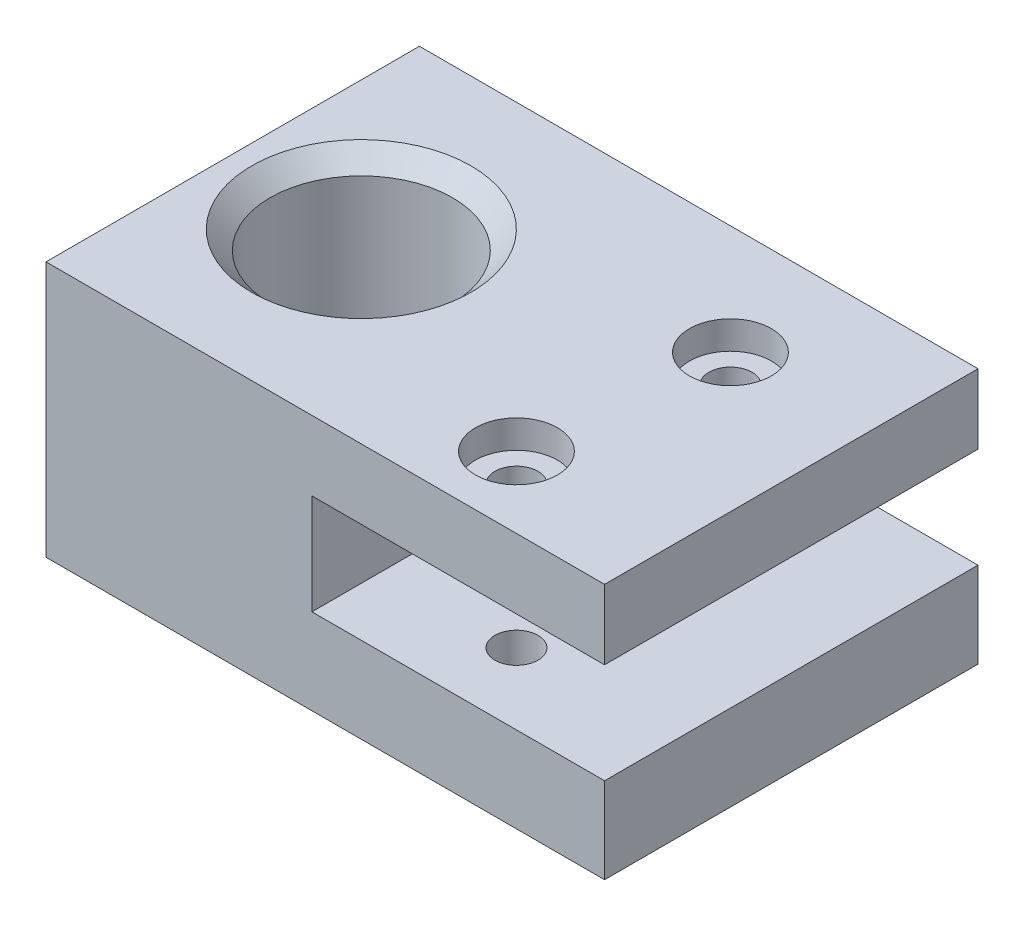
ISO-10303-21;
HEADER;
FILE_DESCRIPTION(('STEP AP214'),'2;1');
FILE_NAME('part.step','',(''),(''),'','','');
FILE_SCHEMA(('AUTOMOTIVE_DESIGN { 1 0 10303 214 1 1 1 1 }'));
ENDSEC;
DATA;
#1=APPLICATION_CONTEXT('core data for automotive mechanical design processes');
#2=APPLICATION_PROTOCOL_DEFINITION('international standard','automotive_design',2000,#1);
#3=PRODUCT_CONTEXT('',#1,'mechanical');
#4=PRODUCT('Part','Part','',(#3));
#5=PRODUCT_RELATED_PRODUCT_CATEGORY('part','',(#4));
#6=PRODUCT_DEFINITION_FORMATION('','',#4);
#7=PRODUCT_DEFINITION_CONTEXT('part definition',#1,'design');
#8=PRODUCT_DEFINITION('design','',#6,#7);
#9=PRODUCT_DEFINITION_SHAPE('','',#8);
#10=(LENGTH_UNIT() NAMED_UNIT(*) SI_UNIT(.MILLI.,.METRE.));
#11=(NAMED_UNIT(*) PLANE_ANGLE_UNIT() SI_UNIT($,.RADIAN.));
#12=(NAMED_UNIT(*) SI_UNIT($,.STERADIAN.) SOLID_ANGLE_UNIT());
#13=UNCERTAINTY_MEASURE_WITH_UNIT(LENGTH_MEASURE(1.E-05),#10,'distance_accuracy_value','');
#14=(GEOMETRIC_REPRESENTATION_CONTEXT(3) GLOBAL_UNCERTAINTY_ASSIGNED_CONTEXT((#13)) GLOBAL_UNIT_ASSIGNED_CONTEXT((#10,
#11,#12)) REPRESENTATION_CONTEXT('',''));
#15=CARTESIAN_POINT('',(0.,0.,0.));
#16=DIRECTION('',(0.,0.,1.));
#17=DIRECTION('',(1.,0.,0.));
#18=AXIS2_PLACEMENT_3D('',#15,#16,#17);
#19=CARTESIAN_POINT('',(90.5104219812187,70.612,-44.268252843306));
#20=DIRECTION('',(-1.,0.,0.));
#21=DIRECTION('',(0.,0.,1.));
#22=AXIS2_PLACEMENT_3D('',#19,#20,#21);
#23=PLANE('',#22);
#24=DIRECTION('',(0.,-1.,0.));
#25=VECTOR('',#24,1.);
#26=CARTESIAN_POINT('',(90.5104219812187,70.612,-44.268252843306));
#27=LINE('',#26,#25);
#28=CARTESIAN_POINT('',(90.5104219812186,23.660106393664,-44.2682528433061));
#29=VERTEX_POINT('',#28);
#30=CARTESIAN_POINT('',(90.5104219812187,0.,-44.268252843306));
#31=VERTEX_POINT('',#30);
#32=EDGE_CURVE('E150',#29,#31,#27,.T.);
#33=ORIENTED_EDGE('',*,*,#32,.F.);
#34=DIRECTION('',(0.,0.,1.));
#35=VECTOR('',#34,1.);
#36=CARTESIAN_POINT('',(90.5104219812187,23.660106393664,-44.268252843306));
#37=LINE('',#36,#35);
#38=CARTESIAN_POINT('',(90.5104219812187,23.660106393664,58.8040970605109));
#39=VERTEX_POINT('',#38);
#40=EDGE_CURVE('E126',#29,#39,#37,.T.);
#41=ORIENTED_EDGE('',*,*,#40,.T.);
#42=DIRECTION('',(0.,-1.,0.));
#43=VECTOR('',#42,1.);
#44=CARTESIAN_POINT('',(90.5104219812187,70.612,58.8040970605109));
#45=LINE('',#44,#43);
#46=CARTESIAN_POINT('',(90.5104219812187,0.,58.8040970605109));
#47=VERTEX_POINT('',#46);
#48=EDGE_CURVE('E154',#39,#47,#45,.T.);
#49=ORIENTED_EDGE('',*,*,#48,.T.);
#50=DIRECTION('',(0.,0.,-1.));
#51=VECTOR('',#50,1.);
#52=CARTESIAN_POINT('',(90.5104219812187,0.,-44.268252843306));
#53=LINE('',#52,#51);
#54=EDGE_CURVE('E135',#47,#31,#53,.T.);
#55=ORIENTED_EDGE('',*,*,#54,.T.);
#56=EDGE_LOOP('',(#33,#41,#49,#55));
#57=FACE_BOUND('',#56,.T.);
#58=ADVANCED_FACE('F27',(#57),#23,.F.);
#59=CARTESIAN_POINT('',(-63.6576227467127,70.612,-44.268252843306));
#60=DIRECTION('',(1.,0.,0.));
#61=DIRECTION('',(0.,0.,-1.));
#62=AXIS2_PLACEMENT_3D('',#59,#60,#61);
#63=PLANE('',#62);
#64=DIRECTION('',(0.,0.,1.));
#65=VECTOR('',#64,1.);
#66=CARTESIAN_POINT('',(-63.6576227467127,0.,-44.268252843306));
#67=LINE('',#66,#65);
#68=CARTESIAN_POINT('',(-63.6576227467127,0.,-44.268252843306));
#69=VERTEX_POINT('',#68);
#70=CARTESIAN_POINT('',(-63.6576227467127,0.,58.8040970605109));
#71=VERTEX_POINT('',#70);
#72=EDGE_CURVE('E129',#69,#71,#67,.T.);
#73=ORIENTED_EDGE('',*,*,#72,.T.);
#74=DIRECTION('',(0.,-1.,0.));
#75=VECTOR('',#74,1.);
#76=CARTESIAN_POINT('',(-63.6576227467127,70.612,58.8040970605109));
#77=LINE('',#76,#75);
#78=CARTESIAN_POINT('',(-63.6576227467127,70.612,58.8040970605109));
#79=VERTEX_POINT('',#78);
#80=EDGE_CURVE('E157',#79,#71,#77,.T.);
#81=ORIENTED_EDGE('',*,*,#80,.F.);
#82=DIRECTION('',(0.,0.,1.));
#83=VECTOR('',#82,1.);
#84=CARTESIAN_POINT('',(-63.6576227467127,70.612,-44.268252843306));
#85=LINE('',#84,#83);
#86=CARTESIAN_POINT('',(-63.6576227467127,70.612,-44.268252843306));
#87=VERTEX_POINT('',#86);
#88=EDGE_CURVE('E140',#87,#79,#85,.T.);
#89=ORIENTED_EDGE('',*,*,#88,.F.);
#90=DIRECTION('',(0.,-1.,0.));
#91=VECTOR('',#90,1.);
#92=CARTESIAN_POINT('',(-63.6576227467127,70.612,-44.268252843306));
#93=LINE('',#92,#91);
#94=EDGE_CURVE('E147',#87,#69,#93,.T.);
#95=ORIENTED_EDGE('',*,*,#94,.T.);
#96=EDGE_LOOP('',(#73,#81,#89,#95));
#97=FACE_BOUND('',#96,.T.);
#98=ADVANCED_FACE('F29',(#97),#63,.F.);
#99=CARTESIAN_POINT('',(-63.6576227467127,70.612,58.8040970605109));
#100=DIRECTION('',(0.,0.,-1.));
#101=DIRECTION('',(-1.,0.,0.));
#102=AXIS2_PLACEMENT_3D('',#99,#100,#101);
#103=PLANE('',#102);
#104=ORIENTED_EDGE('',*,*,#48,.F.);
#105=DIRECTION('',(1.,0.,0.));
#106=VECTOR('',#105,1.);
#107=CARTESIAN_POINT('',(93.7683238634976,23.660106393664,58.8040970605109));
#108=LINE('',#107,#106);
#109=CARTESIAN_POINT('',(9.74099024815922,23.660106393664,58.8040970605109));
#110=VERTEX_POINT('',#109);
#111=EDGE_CURVE('E116',#110,#39,#108,.T.);
#112=ORIENTED_EDGE('',*,*,#111,.F.);
#113=DIRECTION('',(0.,-1.,0.));
#114=VECTOR('',#113,1.);
#115=CARTESIAN_POINT('',(9.74099024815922,51.3743848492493,58.8040970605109));
#116=LINE('',#115,#114);
#117=CARTESIAN_POINT('',(9.74099024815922,51.3743848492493,58.8040970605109));
#118=VERTEX_POINT('',#117);
#119=EDGE_CURVE('E105',#118,#110,#116,.T.);
#120=ORIENTED_EDGE('',*,*,#119,.F.);
#121=DIRECTION('',(-1.,0.,0.));
#122=VECTOR('',#121,1.);
#123=CARTESIAN_POINT('',(93.7683238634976,51.3743848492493,58.8040970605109));
#124=LINE('',#123,#122);
#125=CARTESIAN_POINT('',(90.5104219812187,51.3743848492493,58.8040970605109));
#126=VERTEX_POINT('',#125);
#127=EDGE_CURVE('E95',#126,#118,#124,.T.);
#128=ORIENTED_EDGE('',*,*,#127,.F.);
#129=CARTESIAN_POINT('',(90.5104219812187,70.612,58.8040970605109));
#130=VERTEX_POINT('',#129);
#131=EDGE_CURVE('E155',#130,#126,#45,.T.);
#132=ORIENTED_EDGE('',*,*,#131,.F.);
#133=DIRECTION('',(1.,0.,0.));
#134=VECTOR('',#133,1.);
#135=CARTESIAN_POINT('',(-63.6576227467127,70.612,58.8040970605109));
#136=LINE('',#135,#134);
#137=EDGE_CURVE('E142',#79,#130,#136,.T.);
#138=ORIENTED_EDGE('',*,*,#137,.F.);
#139=ORIENTED_EDGE('',*,*,#80,.T.);
#140=DIRECTION('',(1.,0.,0.));
#141=VECTOR('',#140,1.);
#142=CARTESIAN_POINT('',(-63.6576227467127,0.,58.8040970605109));
#143=LINE('',#142,#141);
#144=EDGE_CURVE('E132',#71,#47,#143,.T.);
#145=ORIENTED_EDGE('',*,*,#144,.T.);
#146=EDGE_LOOP('',(#104,#112,#120,#128,#132,#138,#139,#145));
#147=FACE_BOUND('',#146,.T.);
#148=ADVANCED_FACE('F115',(#147),#103,.F.);
#149=ORIENTED_EDGE('',*,*,#131,.T.);
#150=DIRECTION('',(0.,0.,-1.));
#151=VECTOR('',#150,1.);
#152=CARTESIAN_POINT('',(90.5104219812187,51.3743848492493,-44.268252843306));
#153=LINE('',#152,#151);
#154=CARTESIAN_POINT('',(90.5104219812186,51.3743848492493,-44.2682528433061));
#155=VERTEX_POINT('',#154);
#156=EDGE_CURVE('E100',#126,#155,#153,.T.);
#157=ORIENTED_EDGE('',*,*,#156,.T.);
#158=CARTESIAN_POINT('',(90.5104219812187,70.612,-44.268252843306));
#159=VERTEX_POINT('',#158);
#160=EDGE_CURVE('E151',#159,#155,#27,.T.);
#161=ORIENTED_EDGE('',*,*,#160,.F.);
#162=DIRECTION('',(0.,0.,-1.));
#163=VECTOR('',#162,1.);
#164=CARTESIAN_POINT('',(90.5104219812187,70.612,-44.268252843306));
#165=LINE('',#164,#163);
#166=EDGE_CURVE('E144',#130,#159,#165,.T.);
#167=ORIENTED_EDGE('',*,*,#166,.F.);
#168=EDGE_LOOP('',(#149,#157,#161,#167));
#169=FACE_BOUND('',#168,.T.);
#170=ADVANCED_FACE('F203',(#169),#23,.F.);
#171=CARTESIAN_POINT('',(-63.6576227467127,70.612,-44.268252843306));
#172=DIRECTION('',(0.,0.,1.));
#173=DIRECTION('',(1.,0.,0.));
#174=AXIS2_PLACEMENT_3D('',#171,#172,#173);
#175=PLANE('',#174);
#176=DIRECTION('',(0.,-1.,0.));
#177=VECTOR('',#176,1.);
#178=CARTESIAN_POINT('',(9.74099024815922,51.3743848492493,-44.2682528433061));
#179=LINE('',#178,#177);
#180=CARTESIAN_POINT('',(9.74099024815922,51.3743848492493,-44.268252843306));
#181=VERTEX_POINT('',#180);
#182=CARTESIAN_POINT('',(9.74099024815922,23.660106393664,-44.2682528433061));
#183=VERTEX_POINT('',#182);
#184=EDGE_CURVE('E44',#181,#183,#179,.T.);
#185=ORIENTED_EDGE('',*,*,#184,.T.);
#186=DIRECTION('',(1.,0.,0.));
#187=VECTOR('',#186,1.);
#188=CARTESIAN_POINT('',(93.7683238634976,23.660106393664,-44.2682528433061));
#189=LINE('',#188,#187);
#190=EDGE_CURVE('E112',#183,#29,#189,.T.);
#191=ORIENTED_EDGE('',*,*,#190,.T.);
#192=ORIENTED_EDGE('',*,*,#32,.T.);
#193=DIRECTION('',(-1.,0.,0.));
#194=VECTOR('',#193,1.);
#195=CARTESIAN_POINT('',(-63.6576227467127,0.,-44.268252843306));
#196=LINE('',#195,#194);
#197=EDGE_CURVE('E138',#31,#69,#196,.T.);
#198=ORIENTED_EDGE('',*,*,#197,.T.);
#199=ORIENTED_EDGE('',*,*,#94,.F.);
#200=DIRECTION('',(-1.,0.,0.));
#201=VECTOR('',#200,1.);
#202=CARTESIAN_POINT('',(-63.6576227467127,70.612,-44.268252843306));
#203=LINE('',#202,#201);
#204=EDGE_CURVE('E52',#159,#87,#203,.T.);
#205=ORIENTED_EDGE('',*,*,#204,.F.);
#206=ORIENTED_EDGE('',*,*,#160,.T.);
#207=DIRECTION('',(-1.,0.,0.));
#208=VECTOR('',#207,1.);
#209=CARTESIAN_POINT('',(-63.6576227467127,51.3743848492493,-44.268252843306));
#210=LINE('',#209,#208);
#211=EDGE_CURVE('E160',#155,#181,#210,.T.);
#212=ORIENTED_EDGE('',*,*,#211,.T.);
#213=EDGE_LOOP('',(#185,#191,#192,#198,#199,#205,#206,#212));
#214=FACE_BOUND('',#213,.T.);
#215=ADVANCED_FACE('F212',(#214),#175,.F.);
#216=CARTESIAN_POINT('',(-63.6576227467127,70.612,58.8040970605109));
#217=DIRECTION('',(0.,1.,0.));
#218=DIRECTION('',(0.,0.,1.));
#219=AXIS2_PLACEMENT_3D('',#216,#217,#218);
#220=PLANE('',#219);
#221=CARTESIAN_POINT('',(52.4104219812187,70.612,-14.040679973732));
#222=DIRECTION('',(0.,1.,0.));
#223=DIRECTION('',(0.,0.,1.));
#224=AXIS2_PLACEMENT_3D('',#221,#222,#223);
#225=CIRCLE('',#224,11.31062);
#226=CARTESIAN_POINT('',(52.4104219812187,70.612,-2.73005997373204));
#227=VERTEX_POINT('',#226);
#228=EDGE_CURVE('E249',#227,#227,#225,.T.);
#229=ORIENTED_EDGE('',*,*,#228,.F.);
#230=EDGE_LOOP('',(#229));
#231=FACE_BOUND('',#230,.T.);
#232=CARTESIAN_POINT('',(46.5618147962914,70.612,39.1738708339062));
#233=DIRECTION('',(0.,1.,0.));
#234=DIRECTION('',(0.,0.,1.));
#235=AXIS2_PLACEMENT_3D('',#232,#233,#234);
#236=CIRCLE('',#235,11.31062);
#237=CARTESIAN_POINT('',(46.5618147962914,70.612,50.4844908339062));
#238=VERTEX_POINT('',#237);
#239=EDGE_CURVE('E166',#238,#238,#236,.T.);
#240=ORIENTED_EDGE('',*,*,#239,.F.);
#241=EDGE_LOOP('',(#240));
#242=FACE_BOUND('',#241,.T.);
#243=CARTESIAN_POINT('',(-27.9715870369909,70.612,7.45869624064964));
#244=DIRECTION('',(0.,1.,0.));
#245=DIRECTION('',(0.,0.,1.));
#246=AXIS2_PLACEMENT_3D('',#243,#244,#245);
#247=CIRCLE('',#246,30.2621854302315);
#248=CARTESIAN_POINT('',(-27.9715870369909,70.612,37.7208816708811));
#249=VERTEX_POINT('',#248);
#250=EDGE_CURVE('E11',#249,#249,#247,.F.);
#251=ORIENTED_EDGE('',*,*,#250,.T.);
#252=EDGE_LOOP('',(#251));
#253=FACE_BOUND('',#252,.T.);
#254=ORIENTED_EDGE('',*,*,#88,.T.);
#255=ORIENTED_EDGE('',*,*,#137,.T.);
#256=ORIENTED_EDGE('',*,*,#166,.T.);
#257=ORIENTED_EDGE('',*,*,#204,.T.);
#258=EDGE_LOOP('',(#254,#255,#256,#257));
#259=FACE_BOUND('',#258,.T.);
#260=ADVANCED_FACE('F217',(#231,#242,#253,#259),#220,.T.);
#261=CARTESIAN_POINT('',(-63.6576227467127,0.,58.8040970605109));
#262=DIRECTION('',(0.,1.,0.));
#263=DIRECTION('',(0.,0.,1.));
#264=AXIS2_PLACEMENT_3D('',#261,#262,#263);
#265=PLANE('',#264);
#266=CARTESIAN_POINT('',(52.4104219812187,0.,-14.040679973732));
#267=DIRECTION('',(0.,1.,0.));
#268=DIRECTION('',(0.,0.,1.));
#269=AXIS2_PLACEMENT_3D('',#266,#267,#268);
#270=CIRCLE('',#269,5.95248999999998);
#271=CARTESIAN_POINT('',(52.4104219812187,0.,-8.08818997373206));
#272=VERTEX_POINT('',#271);
#273=EDGE_CURVE('E308',#272,#272,#270,.T.);
#274=ORIENTED_EDGE('',*,*,#273,.T.);
#275=EDGE_LOOP('',(#274));
#276=FACE_BOUND('',#275,.T.);
#277=CARTESIAN_POINT('',(46.5618147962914,0.,39.1738708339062));
#278=DIRECTION('',(0.,1.,0.));
#279=DIRECTION('',(0.,0.,1.));
#280=AXIS2_PLACEMENT_3D('',#277,#278,#279);
#281=CIRCLE('',#280,5.95248999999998);
#282=CARTESIAN_POINT('',(46.5618147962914,0.,45.1263608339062));
#283=VERTEX_POINT('',#282);
#284=EDGE_CURVE('E265',#283,#283,#281,.T.);
#285=ORIENTED_EDGE('',*,*,#284,.T.);
#286=EDGE_LOOP('',(#285));
#287=FACE_BOUND('',#286,.T.);
#288=CARTESIAN_POINT('',(-27.9715870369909,0.,7.45869624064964));
#289=DIRECTION('',(0.,1.,0.));
#290=DIRECTION('',(0.,0.,1.));
#291=AXIS2_PLACEMENT_3D('',#288,#289,#290);
#292=CIRCLE('',#291,25.1821854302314);
#293=CARTESIAN_POINT('',(-27.9715870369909,0.,32.6408816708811));
#294=VERTEX_POINT('',#293);
#295=EDGE_CURVE('E106',#294,#294,#292,.T.);
#296=ORIENTED_EDGE('',*,*,#295,.T.);
#297=EDGE_LOOP('',(#296));
#298=FACE_BOUND('',#297,.T.);
#299=ORIENTED_EDGE('',*,*,#72,.F.);
#300=ORIENTED_EDGE('',*,*,#197,.F.);
#301=ORIENTED_EDGE('',*,*,#54,.F.);
#302=ORIENTED_EDGE('',*,*,#144,.F.);
#303=EDGE_LOOP('',(#299,#300,#301,#302));
#304=FACE_BOUND('',#303,.T.);
#305=ADVANCED_FACE('F183',(#276,#287,#298,#304),#265,.F.);
#306=CARTESIAN_POINT('',(93.7683238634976,23.660106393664,-44.2682528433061));
#307=DIRECTION('',(0.,-1.,0.));
#308=DIRECTION('',(0.,0.,-1.));
#309=AXIS2_PLACEMENT_3D('',#306,#307,#308);
#310=PLANE('',#309);
#311=CARTESIAN_POINT('',(52.4104219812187,23.660106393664,-14.040679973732));
#312=DIRECTION('',(0.,-1.,0.));
#313=DIRECTION('',(0.,0.,-1.));
#314=AXIS2_PLACEMENT_3D('',#311,#312,#313);
#315=CIRCLE('',#314,5.95248999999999);
#316=CARTESIAN_POINT('',(52.4104219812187,23.660106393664,-19.993169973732));
#317=VERTEX_POINT('',#316);
#318=EDGE_CURVE('E258',#317,#317,#315,.T.);
#319=ORIENTED_EDGE('',*,*,#318,.T.);
#320=EDGE_LOOP('',(#319));
#321=FACE_BOUND('',#320,.T.);
#322=CARTESIAN_POINT('',(46.5618147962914,23.660106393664,39.1738708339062));
#323=DIRECTION('',(0.,-1.,0.));
#324=DIRECTION('',(0.,0.,-1.));
#325=AXIS2_PLACEMENT_3D('',#322,#323,#324);
#326=CIRCLE('',#325,5.95248999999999);
#327=CARTESIAN_POINT('',(46.5618147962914,23.660106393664,33.2213808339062));
#328=VERTEX_POINT('',#327);
#329=EDGE_CURVE('E165',#328,#328,#326,.T.);
#330=ORIENTED_EDGE('',*,*,#329,.T.);
#331=EDGE_LOOP('',(#330));
#332=FACE_BOUND('',#331,.T.);
#333=ORIENTED_EDGE('',*,*,#190,.F.);
#334=DIRECTION('',(0.,0.,1.));
#335=VECTOR('',#334,1.);
#336=CARTESIAN_POINT('',(9.74099024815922,23.660106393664,-44.2682528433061));
#337=LINE('',#336,#335);
#338=EDGE_CURVE('E111',#183,#110,#337,.T.);
#339=ORIENTED_EDGE('',*,*,#338,.T.);
#340=ORIENTED_EDGE('',*,*,#111,.T.);
#341=ORIENTED_EDGE('',*,*,#40,.F.);
#342=EDGE_LOOP('',(#333,#339,#340,#341));
#343=FACE_BOUND('',#342,.T.);
#344=ADVANCED_FACE('F228',(#321,#332,#343),#310,.F.);
#345=CARTESIAN_POINT('',(93.7683238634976,51.3743848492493,-44.2682528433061));
#346=DIRECTION('',(0.,1.,0.));
#347=DIRECTION('',(0.,0.,1.));
#348=AXIS2_PLACEMENT_3D('',#345,#346,#347);
#349=PLANE('',#348);
#350=CARTESIAN_POINT('',(52.4104219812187,51.3743848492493,-14.040679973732));
#351=DIRECTION('',(0.,1.,0.));
#352=DIRECTION('',(0.,0.,1.));
#353=AXIS2_PLACEMENT_3D('',#350,#351,#352);
#354=CIRCLE('',#353,5.95248999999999);
#355=CARTESIAN_POINT('',(52.4104219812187,51.3743848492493,-8.08818997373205));
#356=VERTEX_POINT('',#355);
#357=EDGE_CURVE('E31',#356,#356,#354,.T.);
#358=ORIENTED_EDGE('',*,*,#357,.T.);
#359=EDGE_LOOP('',(#358));
#360=FACE_BOUND('',#359,.T.);
#361=CARTESIAN_POINT('',(46.5618147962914,51.3743848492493,39.1738708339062));
#362=DIRECTION('',(0.,1.,0.));
#363=DIRECTION('',(0.,0.,1.));
#364=AXIS2_PLACEMENT_3D('',#361,#362,#363);
#365=CIRCLE('',#364,5.95248999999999);
#366=CARTESIAN_POINT('',(46.5618147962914,51.3743848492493,45.1263608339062));
#367=VERTEX_POINT('',#366);
#368=EDGE_CURVE('E163',#367,#367,#365,.T.);
#369=ORIENTED_EDGE('',*,*,#368,.T.);
#370=EDGE_LOOP('',(#369));
#371=FACE_BOUND('',#370,.T.);
#372=ORIENTED_EDGE('',*,*,#127,.T.);
#373=DIRECTION('',(0.,0.,1.));
#374=VECTOR('',#373,1.);
#375=CARTESIAN_POINT('',(9.74099024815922,51.3743848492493,-44.2682528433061));
#376=LINE('',#375,#374);
#377=EDGE_CURVE('E97',#181,#118,#376,.T.);
#378=ORIENTED_EDGE('',*,*,#377,.F.);
#379=ORIENTED_EDGE('',*,*,#211,.F.);
#380=ORIENTED_EDGE('',*,*,#156,.F.);
#381=EDGE_LOOP('',(#372,#378,#379,#380));
#382=FACE_BOUND('',#381,.T.);
#383=ADVANCED_FACE('F96',(#360,#371,#382),#349,.F.);
#384=CARTESIAN_POINT('',(9.74099024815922,51.3743848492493,-44.2682528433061));
#385=DIRECTION('',(-1.,0.,0.));
#386=DIRECTION('',(0.,0.,1.));
#387=AXIS2_PLACEMENT_3D('',#384,#385,#386);
#388=PLANE('',#387);
#389=ORIENTED_EDGE('',*,*,#119,.T.);
#390=ORIENTED_EDGE('',*,*,#338,.F.);
#391=ORIENTED_EDGE('',*,*,#184,.F.);
#392=ORIENTED_EDGE('',*,*,#377,.T.);
#393=EDGE_LOOP('',(#389,#390,#391,#392));
#394=FACE_BOUND('',#393,.T.);
#395=ADVANCED_FACE('F109',(#394),#388,.F.);
#396=CARTESIAN_POINT('',(-27.9715870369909,0.,7.45869624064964));
#397=DIRECTION('',(0.,1.,0.));
#398=DIRECTION('',(0.,0.,1.));
#399=AXIS2_PLACEMENT_3D('',#396,#397,#398);
#400=CYLINDRICAL_SURFACE('',#399,25.1821854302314);
#401=CARTESIAN_POINT('',(-27.9715870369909,65.532,7.45869624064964));
#402=DIRECTION('',(0.,1.,0.));
#403=DIRECTION('',(0.,0.,1.));
#404=AXIS2_PLACEMENT_3D('',#401,#402,#403);
#405=CIRCLE('',#404,25.1821854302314);
#406=CARTESIAN_POINT('',(-27.9715870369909,65.532,32.6408816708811));
#407=VERTEX_POINT('',#406);
#408=EDGE_CURVE('E36',#407,#407,#405,.T.);
#409=ORIENTED_EDGE('',*,*,#408,.T.);
#410=EDGE_LOOP('',(#409));
#411=FACE_BOUND('',#410,.T.);
#412=ORIENTED_EDGE('',*,*,#295,.F.);
#413=EDGE_LOOP('',(#412));
#414=FACE_BOUND('',#413,.T.);
#415=ADVANCED_FACE('F186',(#411,#414),#400,.F.);
#416=CARTESIAN_POINT('',(-27.9715870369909,65.532,7.45869624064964));
#417=DIRECTION('',(0.,1.,0.));
#418=DIRECTION('',(0.,0.,1.));
#419=AXIS2_PLACEMENT_3D('',#416,#417,#418);
#420=CONICAL_SURFACE('',#419,25.1821854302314,0.78539816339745);
#421=CARTESIAN_POINT('',(-27.9715870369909,70.612,37.7208816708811));
#422=CARTESIAN_POINT('',(-27.9715870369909,70.5590833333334,37.6679650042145));
#423=CARTESIAN_POINT('',(-27.9715870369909,70.5061666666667,37.6150483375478));
#424=CARTESIAN_POINT('',(-27.9715870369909,70.4003333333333,37.5092150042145));
#425=CARTESIAN_POINT('',(-27.9715870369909,70.3474166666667,37.4562983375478));
#426=CARTESIAN_POINT('',(-27.9715870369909,70.2415833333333,37.3504650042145));
#427=CARTESIAN_POINT('',(-27.9715870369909,70.1886666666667,37.2975483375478));
#428=CARTESIAN_POINT('',(-27.9715870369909,70.0828333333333,37.1917150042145));
#429=CARTESIAN_POINT('',(-27.9715870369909,70.0299166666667,37.1387983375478));
#430=CARTESIAN_POINT('',(-27.9715870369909,69.9240833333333,37.0329650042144));
#431=CARTESIAN_POINT('',(-27.9715870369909,69.8711666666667,36.9800483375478));
#432=CARTESIAN_POINT('',(-27.9715870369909,69.7653333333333,36.8742150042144));
#433=CARTESIAN_POINT('',(-27.9715870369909,69.7124166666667,36.8212983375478));
#434=CARTESIAN_POINT('',(-27.9715870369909,69.6065833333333,36.7154650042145));
#435=CARTESIAN_POINT('',(-27.9715870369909,69.5536666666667,36.6625483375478));
#436=CARTESIAN_POINT('',(-27.9715870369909,69.4478333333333,36.5567150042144));
#437=CARTESIAN_POINT('',(-27.9715870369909,69.3949166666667,36.5037983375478));
#438=CARTESIAN_POINT('',(-27.9715870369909,69.2890833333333,36.3979650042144));
#439=CARTESIAN_POINT('',(-27.9715870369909,69.2361666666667,36.3450483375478));
#440=CARTESIAN_POINT('',(-27.9715870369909,69.1303333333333,36.2392150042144));
#441=CARTESIAN_POINT('',(-27.9715870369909,69.0774166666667,36.1862983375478));
#442=CARTESIAN_POINT('',(-27.9715870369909,68.9715833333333,36.0804650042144));
#443=CARTESIAN_POINT('',(-27.9715870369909,68.9186666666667,36.0275483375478));
#444=CARTESIAN_POINT('',(-27.9715870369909,68.8128333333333,35.9217150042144));
#445=CARTESIAN_POINT('',(-27.9715870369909,68.7599166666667,35.8687983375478));
#446=CARTESIAN_POINT('',(-27.9715870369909,68.6540833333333,35.7629650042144));
#447=CARTESIAN_POINT('',(-27.9715870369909,68.6011666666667,35.7100483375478));
#448=CARTESIAN_POINT('',(-27.9715870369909,68.4953333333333,35.6042150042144));
#449=CARTESIAN_POINT('',(-27.9715870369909,68.4424166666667,35.5512983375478));
#450=CARTESIAN_POINT('',(-27.9715870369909,68.3365833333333,35.4454650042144));
#451=CARTESIAN_POINT('',(-27.9715870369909,68.2836666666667,35.3925483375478));
#452=CARTESIAN_POINT('',(-27.9715870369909,68.1778333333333,35.2867150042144));
#453=CARTESIAN_POINT('',(-27.9715870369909,68.1249166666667,35.2337983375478));
#454=CARTESIAN_POINT('',(-27.9715870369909,68.0190833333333,35.1279650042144));
#455=CARTESIAN_POINT('',(-27.9715870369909,67.9661666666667,35.0750483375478));
#456=CARTESIAN_POINT('',(-27.9715870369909,67.8603333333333,34.9692150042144));
#457=CARTESIAN_POINT('',(-27.9715870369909,67.8074166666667,34.9162983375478));
#458=CARTESIAN_POINT('',(-27.9715870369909,67.7015833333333,34.8104650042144));
#459=CARTESIAN_POINT('',(-27.9715870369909,67.6486666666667,34.7575483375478));
#460=CARTESIAN_POINT('',(-27.9715870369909,67.5428333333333,34.6517150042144));
#461=CARTESIAN_POINT('',(-27.9715870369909,67.4899166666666,34.5987983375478));
#462=CARTESIAN_POINT('',(-27.9715870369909,67.3840833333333,34.4929650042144));
#463=CARTESIAN_POINT('',(-27.9715870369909,67.3311666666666,34.4400483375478));
#464=CARTESIAN_POINT('',(-27.9715870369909,67.2253333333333,34.3342150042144));
#465=CARTESIAN_POINT('',(-27.9715870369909,67.1724166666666,34.2812983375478));
#466=CARTESIAN_POINT('',(-27.9715870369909,67.0665833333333,34.1754650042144));
#467=CARTESIAN_POINT('',(-27.9715870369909,67.0136666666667,34.1225483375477));
#468=CARTESIAN_POINT('',(-27.9715870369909,66.9078333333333,34.0167150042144));
#469=CARTESIAN_POINT('',(-27.9715870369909,66.8549166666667,33.9637983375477));
#470=CARTESIAN_POINT('',(-27.9715870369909,66.7490833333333,33.8579650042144));
#471=CARTESIAN_POINT('',(-27.9715870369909,66.6961666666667,33.8050483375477));
#472=CARTESIAN_POINT('',(-27.9715870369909,66.5903333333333,33.6992150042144));
#473=CARTESIAN_POINT('',(-27.9715870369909,66.5374166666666,33.6462983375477));
#474=CARTESIAN_POINT('',(-27.9715870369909,66.4315833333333,33.5404650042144));
#475=CARTESIAN_POINT('',(-27.9715870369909,66.3786666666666,33.4875483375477));
#476=CARTESIAN_POINT('',(-27.9715870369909,66.2728333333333,33.3817150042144));
#477=CARTESIAN_POINT('',(-27.9715870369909,66.2199166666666,33.3287983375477));
#478=CARTESIAN_POINT('',(-27.9715870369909,66.1140833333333,33.2229650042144));
#479=CARTESIAN_POINT('',(-27.9715870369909,66.0611666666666,33.1700483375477));
#480=CARTESIAN_POINT('',(-27.9715870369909,65.9553333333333,33.0642150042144));
#481=CARTESIAN_POINT('',(-27.9715870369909,65.9024166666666,33.0112983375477));
#482=CARTESIAN_POINT('',(-27.9715870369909,65.7965833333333,32.9054650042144));
#483=CARTESIAN_POINT('',(-27.9715870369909,65.7436666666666,32.8525483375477));
#484=CARTESIAN_POINT('',(-27.9715870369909,65.6378333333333,32.7467150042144));
#485=CARTESIAN_POINT('',(-27.9715870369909,65.5849166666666,32.6937983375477));
#486=CARTESIAN_POINT('',(-27.9715870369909,65.532,32.6408816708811));
#487=B_SPLINE_CURVE_WITH_KNOTS('',3,(#421,#422,#423,#424,#425,#426,#427,#428,#429,#430,#431,
#432,#433,#434,#435,#436,#437,#438,#439,#440,#441,#442,#443,#444,#445,#446,#447,#448,#449,#450,
#451,#452,#453,#454,#455,#456,#457,#458,#459,#460,#461,#462,#463,#464,#465,#466,#467,#468,#469,
#470,#471,#472,#473,#474,#475,#476,#477,#478,#479,#480,#481,#482,#483,#484,#485,#486),
.UNSPECIFIED.,.F.,.F.,(4,2,2,2,2,2,2,2,2,2,2,2,2,2,2,2,2,2,2,2,2,2,2,2,2,2,2,2,2,2,2,2,4),(0.,
0.224506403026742,0.44901280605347,0.673519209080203,0.89802561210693,1.12253201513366,
1.34703841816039,1.57154482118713,1.79605122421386,2.02055762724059,2.24506403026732,
2.46957043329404,2.69407683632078,2.9185832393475,3.14308964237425,3.36759604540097,
3.5921024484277,3.81660885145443,4.04111525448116,4.26562165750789,4.49012806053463,
4.71463446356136,4.93914086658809,5.16364726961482,5.38815367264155,5.61266007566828,
5.83716647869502,6.06167288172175,6.28617928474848,6.51068568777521,6.73519209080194,
6.95969849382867,7.18420489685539),.UNSPECIFIED.);
#488=EDGE_CURVE('BSEAM188',#249,#407,#487,.T.);
#489=ORIENTED_EDGE('',*,*,#250,.F.);
#490=ORIENTED_EDGE('',*,*,#408,.F.);
#491=ORIENTED_EDGE('',*,*,#488,.T.);
#492=ORIENTED_EDGE('',*,*,#488,.F.);
#493=EDGE_LOOP('',(#489,#491,#490,#492));
#494=FACE_BOUND('',#493,.T.);
#495=ADVANCED_FACE('F188',(#494),#420,.F.);
#496=CARTESIAN_POINT('',(52.5143047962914,62.865,39.1738708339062));
#497=DIRECTION('',(0.,-1.,0.));
#498=DIRECTION('',(0.,0.,-1.));
#499=AXIS2_PLACEMENT_3D('',#496,#497,#498);
#500=PLANE('',#499);
#501=CARTESIAN_POINT('',(46.5618147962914,62.865,39.1738708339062));
#502=DIRECTION('',(0.,1.,0.));
#503=DIRECTION('',(0.,0.,1.));
#504=AXIS2_PLACEMENT_3D('',#501,#502,#503);
#505=CIRCLE('',#504,5.95249);
#506=CARTESIAN_POINT('',(46.5618147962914,62.865,45.1263608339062));
#507=VERTEX_POINT('',#506);
#508=EDGE_CURVE('E177',#507,#507,#505,.T.);
#509=ORIENTED_EDGE('',*,*,#508,.F.);
#510=EDGE_LOOP('',(#509));
#511=FACE_BOUND('',#510,.T.);
#512=CARTESIAN_POINT('',(46.5618147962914,62.865,39.1738708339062));
#513=DIRECTION('',(0.,1.,0.));
#514=DIRECTION('',(0.,0.,1.));
#515=AXIS2_PLACEMENT_3D('',#512,#513,#514);
#516=CIRCLE('',#515,11.31062);
#517=CARTESIAN_POINT('',(46.5618147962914,62.865,50.4844908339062));
#518=VERTEX_POINT('',#517);
#519=EDGE_CURVE('E172',#518,#518,#516,.T.);
#520=ORIENTED_EDGE('',*,*,#519,.T.);
#521=EDGE_LOOP('',(#520));
#522=FACE_BOUND('',#521,.T.);
#523=ADVANCED_FACE('F195',(#511,#522),#500,.F.);
#524=CARTESIAN_POINT('',(46.5618147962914,70.612,39.1738708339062));
#525=DIRECTION('',(0.,1.,0.));
#526=DIRECTION('',(0.,0.,1.));
#527=AXIS2_PLACEMENT_3D('',#524,#525,#526);
#528=CYLINDRICAL_SURFACE('',#527,11.31062);
#529=ORIENTED_EDGE('',*,*,#519,.F.);
#530=EDGE_LOOP('',(#529));
#531=FACE_BOUND('',#530,.T.);
#532=ORIENTED_EDGE('',*,*,#239,.T.);
#533=EDGE_LOOP('',(#532));
#534=FACE_BOUND('',#533,.T.);
#535=ADVANCED_FACE('F275',(#531,#534),#528,.F.);
#536=CARTESIAN_POINT('',(46.5618147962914,70.612,39.1738708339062));
#537=DIRECTION('',(0.,1.,0.));
#538=DIRECTION('',(0.,0.,1.));
#539=AXIS2_PLACEMENT_3D('',#536,#537,#538);
#540=CYLINDRICAL_SURFACE('',#539,5.95248999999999);
#541=ORIENTED_EDGE('',*,*,#508,.T.);
#542=EDGE_LOOP('',(#541));
#543=FACE_BOUND('',#542,.T.);
#544=ORIENTED_EDGE('',*,*,#368,.F.);
#545=EDGE_LOOP('',(#544));
#546=FACE_BOUND('',#545,.T.);
#547=ADVANCED_FACE('F270',(#543,#546),#540,.F.);
#548=ORIENTED_EDGE('',*,*,#284,.F.);
#549=EDGE_LOOP('',(#548));
#550=FACE_BOUND('',#549,.T.);
#551=ORIENTED_EDGE('',*,*,#329,.F.);
#552=EDGE_LOOP('',(#551));
#553=FACE_BOUND('',#552,.T.);
#554=ADVANCED_FACE('F284',(#550,#553),#540,.F.);
#555=CARTESIAN_POINT('',(58.3629119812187,62.865,-14.040679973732));
#556=DIRECTION('',(0.,-1.,0.));
#557=DIRECTION('',(0.,0.,-1.));
#558=AXIS2_PLACEMENT_3D('',#555,#556,#557);
#559=PLANE('',#558);
#560=CARTESIAN_POINT('',(52.4104219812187,62.865,-14.040679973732));
#561=DIRECTION('',(0.,1.,0.));
#562=DIRECTION('',(0.,0.,1.));
#563=AXIS2_PLACEMENT_3D('',#560,#561,#562);
#564=CIRCLE('',#563,5.95249);
#565=CARTESIAN_POINT('',(52.4104219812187,62.865,-8.08818997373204));
#566=VERTEX_POINT('',#565);
#567=EDGE_CURVE('E260',#566,#566,#564,.T.);
#568=ORIENTED_EDGE('',*,*,#567,.F.);
#569=EDGE_LOOP('',(#568));
#570=FACE_BOUND('',#569,.T.);
#571=CARTESIAN_POINT('',(52.4104219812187,62.865,-14.040679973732));
#572=DIRECTION('',(0.,1.,0.));
#573=DIRECTION('',(0.,0.,1.));
#574=AXIS2_PLACEMENT_3D('',#571,#572,#573);
#575=CIRCLE('',#574,11.31062);
#576=CARTESIAN_POINT('',(52.4104219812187,62.865,-2.73005997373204));
#577=VERTEX_POINT('',#576);
#578=EDGE_CURVE('E255',#577,#577,#575,.T.);
#579=ORIENTED_EDGE('',*,*,#578,.T.);
#580=EDGE_LOOP('',(#579));
#581=FACE_BOUND('',#580,.T.);
#582=ADVANCED_FACE('F288',(#570,#581),#559,.F.);
#583=CARTESIAN_POINT('',(52.4104219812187,70.612,-14.040679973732));
#584=DIRECTION('',(0.,1.,0.));
#585=DIRECTION('',(0.,0.,1.));
#586=AXIS2_PLACEMENT_3D('',#583,#584,#585);
#587=CYLINDRICAL_SURFACE('',#586,11.31062);
#588=ORIENTED_EDGE('',*,*,#578,.F.);
#589=EDGE_LOOP('',(#588));
#590=FACE_BOUND('',#589,.T.);
#591=ORIENTED_EDGE('',*,*,#228,.T.);
#592=EDGE_LOOP('',(#591));
#593=FACE_BOUND('',#592,.T.);
#594=ADVANCED_FACE('F290',(#590,#593),#587,.F.);
#595=CARTESIAN_POINT('',(52.4104219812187,70.612,-14.040679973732));
#596=DIRECTION('',(0.,1.,0.));
#597=DIRECTION('',(0.,0.,1.));
#598=AXIS2_PLACEMENT_3D('',#595,#596,#597);
#599=CYLINDRICAL_SURFACE('',#598,5.95248999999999);
#600=ORIENTED_EDGE('',*,*,#567,.T.);
#601=EDGE_LOOP('',(#600));
#602=FACE_BOUND('',#601,.T.);
#603=ORIENTED_EDGE('',*,*,#357,.F.);
#604=EDGE_LOOP('',(#603));
#605=FACE_BOUND('',#604,.T.);
#606=ADVANCED_FACE('F293',(#602,#605),#599,.F.);
#607=ORIENTED_EDGE('',*,*,#273,.F.);
#608=EDGE_LOOP('',(#607));
#609=FACE_BOUND('',#608,.T.);
#610=ORIENTED_EDGE('',*,*,#318,.F.);
#611=EDGE_LOOP('',(#610));
#612=FACE_BOUND('',#611,.T.);
#613=ADVANCED_FACE('F298',(#609,#612),#599,.F.);
#614=CLOSED_SHELL('',(#58,#98,#148,#170,#215,#260,#305,#344,#383,#395,#415,#495,#523,#535,#547,
#554,#582,#594,#606,#613));
#615=MANIFOLD_SOLID_BREP('B2',#614);
#616=ADVANCED_BREP_SHAPE_REPRESENTATION('',(#18,#615),#14);
#617=SHAPE_DEFINITION_REPRESENTATION(#9,#616);
ENDSEC;
END-ISO-10303-21;
